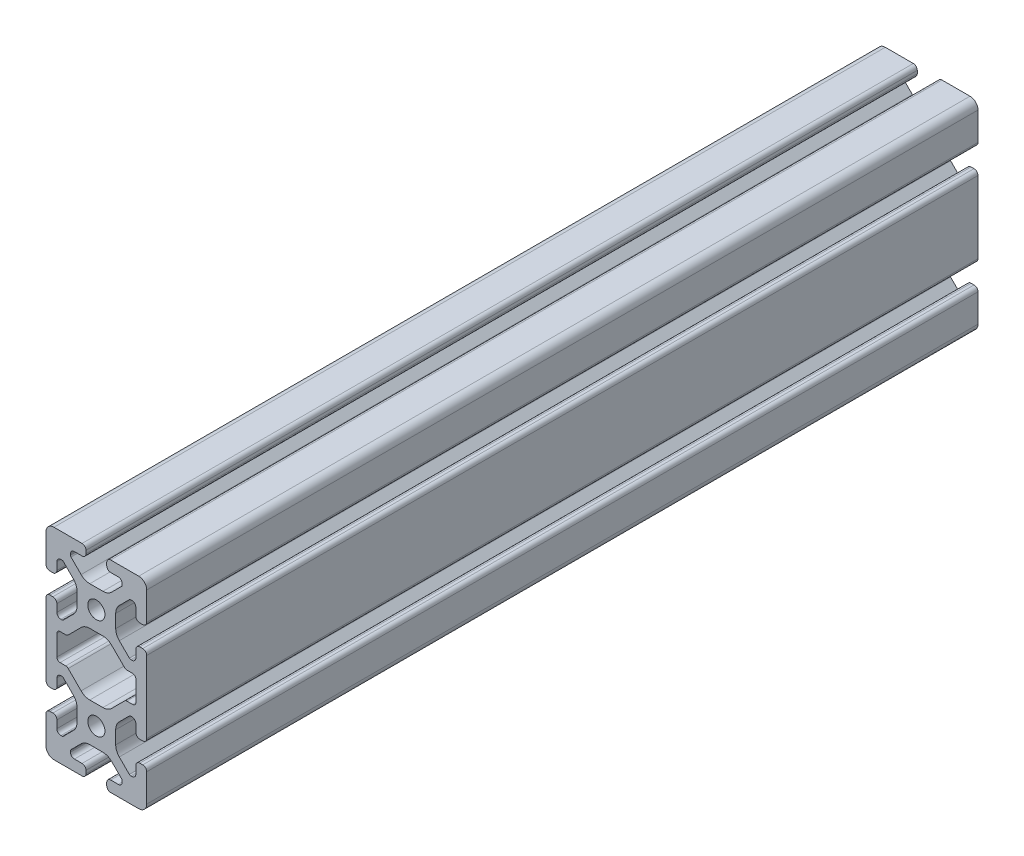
from build123d import *

# Parameters (mm, degrees)
SKETCH1_R           = 3.405
BOSS_EXTRUDE1_DEPTH = 3048
SKETCH26_W          = 40
SKETCH26_H          = 80.80011746
CUT_1_3FT_DEPTH     = 2135.537177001
SKETCH33_W          = 40
SKETCH33_H          = 80.80011746
CUT_2_3FT_DEPTH     = 1221.839317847
SKETCH41_W          = 40
SKETCH41_H          = 80.80011746
CUT_3_1FT_1IN_DEPTH = 892.246879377


with BuildPart() as part:
    # Sketch1 → Boss-Extrude1 (new body)
    with BuildSketch(Plane(origin=(0, 0, -3048), x_dir=(-1, 0, 0), z_dir=(0, 0, -1))):
        with BuildLine():
            Line((16.83, 60), (5.69044933, 60))
            ThreePointArc((5.69044933, 60), (4.580291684, 59.540157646), (4.12044933, 58.43))
            Line((4.12044933, 58.43), (4.12044933, 57.25))
            ThreePointArc((4.12044933, 57.25), (4.580291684, 56.139842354), (5.69044933, 55.68))
            Line((5.69044933, 55.68), (8.7153995, 55.68))
            ThreePointArc((8.7153995, 55.68), (9.825557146, 55.220157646), (10.2853995, 54.11))
            Line((10.2853995, 54.11), (10.2853995, 53.654903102))
            ThreePointArc((10.2853995, 53.654903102), (10.227547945, 53.364063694), (10.062800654, 53.117501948))
            Line((10.062800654, 53.117501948), (6.055092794, 49.109794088))
            ThreePointArc((6.055092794, 49.109794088), (4.47691877, 48.055291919), (2.615335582, 47.685))
            Line((2.615335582, 47.685), (-2.615335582, 47.685))
            ThreePointArc((-2.615335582, 47.685), (-4.47691877, 48.055291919), (-6.055092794, 49.109794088))
            Line((-6.055092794, 49.109794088), (-10.062800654, 53.117501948))
            ThreePointArc((-10.062800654, 53.117501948), (-10.227547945, 53.364063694), (-10.2853995, 53.654903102))
            Line((-10.2853995, 53.654903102), (-10.2853995, 54.11))
            ThreePointArc((-10.2853995, 54.11), (-9.825557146, 55.220157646), (-8.7153995, 55.68))
            Line((-8.7153995, 55.68), (-5.69044933, 55.68))
            ThreePointArc((-5.69044933, 55.68), (-4.580291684, 56.139842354), (-4.12044933, 57.25))
            Line((-4.12044933, 57.25), (-4.12044933, 58.43))
            ThreePointArc((-4.12044933, 58.43), (-4.580291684, 59.540157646), (-5.69044933, 60))
            Line((-5.69044933, 60), (-16.83, 60))
            ThreePointArc((-16.83, 60), (-19.071528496, 59.071528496), (-20, 56.83))
            Line((-20, 56.83), (-20, 45.69044933))
            ThreePointArc((-20, 45.69044933), (-19.540157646, 44.580291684), (-18.43, 44.12044933))
            Line((-18.43, 44.12044933), (-17.25, 44.12044933))
            ThreePointArc((-17.25, 44.12044933), (-16.139842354, 44.580291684), (-15.68, 45.69044933))
            Line((-15.68, 45.69044933), (-15.68, 48.7153995))
            ThreePointArc((-15.68, 48.7153995), (-15.220157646, 49.825557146), (-14.11, 50.2853995))
            Line((-14.11, 50.2853995), (-13.652670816, 50.2853995))
            ThreePointArc((-13.652670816, 50.2853995), (-13.361831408, 50.227547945), (-13.115269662, 50.062800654))
            Line((-13.115269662, 50.062800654), (-9.109794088, 46.05732508))
            ThreePointArc((-9.109794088, 46.05732508), (-8.055291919, 44.479151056), (-7.685, 42.617567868))
            Line((-7.685, 42.617567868), (-7.685, 37.384664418))
            ThreePointArc((-7.685, 37.384664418), (-8.055291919, 35.52308123), (-9.109794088, 33.944907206))
            Line((-9.109794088, 33.944907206), (-13.117501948, 29.937199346))
            ThreePointArc((-13.117501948, 29.937199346), (-13.364063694, 29.772452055), (-13.654903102, 29.7146005))
            Line((-13.654903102, 29.7146005), (-14.11, 29.7146005))
            ThreePointArc((-14.11, 29.7146005), (-15.220157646, 30.174442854), (-15.68, 31.2846005))
            Line((-15.68, 31.2846005), (-15.68, 34.30955067))
            ThreePointArc((-15.68, 34.30955067), (-16.139842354, 35.419708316), (-17.25, 35.87955067))
            Line((-17.25, 35.87955067), (-18.43, 35.87955067))
            ThreePointArc((-18.43, 35.87955067), (-19.540157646, 35.419708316), (-20, 34.30955067))
            Line((-20, 34.30955067), (-20, 5.69044933))
            ThreePointArc((-20, 5.69044933), (-19.540157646, 4.580291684), (-18.43, 4.12044933))
            Line((-18.43, 4.12044933), (-17.25, 4.12044933))
            ThreePointArc((-17.25, 4.12044933), (-16.139842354, 4.580291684), (-15.68, 5.69044933))
            Line((-15.68, 5.69044933), (-15.68, 8.7153995))
            ThreePointArc((-15.68, 8.7153995), (-15.220157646, 9.825557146), (-14.11, 10.2853995))
            Line((-14.11, 10.2853995), (-13.654903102, 10.2853995))
            ThreePointArc((-13.654903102, 10.2853995), (-13.364063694, 10.227547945), (-13.117501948, 10.062800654))
            Line((-13.117501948, 10.062800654), (-9.109794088, 6.055092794))
            ThreePointArc((-9.109794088, 6.055092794), (-8.055291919, 4.47691877), (-7.685, 2.615335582))
            Line((-7.685, 2.615335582), (-7.685, -2.615335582))
            ThreePointArc((-7.685, -2.615335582), (-8.055291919, -4.47691877), (-9.109794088, -6.055092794))
            Line((-9.109794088, -6.055092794), (-13.117501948, -10.062800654))
            ThreePointArc((-13.117501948, -10.062800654), (-13.364063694, -10.227547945), (-13.654903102, -10.2853995))
            Line((-13.654903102, -10.2853995), (-14.11, -10.2853995))
            ThreePointArc((-14.11, -10.2853995), (-15.220157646, -9.825557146), (-15.68, -8.7153995))
            Line((-15.68, -8.7153995), (-15.68, -5.69044933))
            ThreePointArc((-15.68, -5.69044933), (-16.139842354, -4.580291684), (-17.25, -4.12044933))
            Line((-17.25, -4.12044933), (-18.43, -4.12044933))
            ThreePointArc((-18.43, -4.12044933), (-19.540157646, -4.580291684), (-20, -5.69044933))
            Line((-20, -5.69044933), (-20, -16.83))
            ThreePointArc((-20, -16.83), (-19.071528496, -19.071528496), (-16.83, -20))
            Line((-16.83, -20), (-5.69044933, -20))
            ThreePointArc((-5.69044933, -20), (-4.580291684, -19.540157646), (-4.12044933, -18.43))
            Line((-4.12044933, -18.43), (-4.12044933, -17.25))
            ThreePointArc((-4.12044933, -17.25), (-4.580291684, -16.139842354), (-5.69044933, -15.68))
            Line((-5.69044933, -15.68), (-8.7153995, -15.68))
            ThreePointArc((-8.7153995, -15.68), (-9.825557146, -15.220157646), (-10.2853995, -14.11))
            Line((-10.2853995, -14.11), (-10.2853995, -13.654903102))
            ThreePointArc((-10.2853995, -13.654903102), (-10.227547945, -13.364063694), (-10.062800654, -13.117501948))
            Line((-10.062800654, -13.117501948), (-6.055092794, -9.109794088))
            ThreePointArc((-6.055092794, -9.109794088), (-4.47691877, -8.055291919), (-2.615335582, -7.685))
            Line((-2.615335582, -7.685), (2.615335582, -7.685))
            ThreePointArc((2.615335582, -7.685), (4.47691877, -8.055291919), (6.055092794, -9.109794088))
            Line((6.055092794, -9.109794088), (10.062800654, -13.117501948))
            ThreePointArc((10.062800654, -13.117501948), (10.227547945, -13.364063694), (10.2853995, -13.654903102))
            Line((10.2853995, -13.654903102), (10.2853995, -14.11))
            ThreePointArc((10.2853995, -14.11), (9.825557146, -15.220157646), (8.7153995, -15.68))
            Line((8.7153995, -15.68), (5.69044933, -15.68))
            ThreePointArc((5.69044933, -15.68), (4.580291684, -16.139842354), (4.12044933, -17.25))
            Line((4.12044933, -17.25), (4.12044933, -18.43))
            ThreePointArc((4.12044933, -18.43), (4.580291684, -19.540157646), (5.69044933, -20))
            Line((5.69044933, -20), (16.83, -20))
            ThreePointArc((16.83, -20), (19.071528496, -19.071528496), (20, -16.83))
            Line((20, -16.83), (20, -5.69044933))
            ThreePointArc((20, -5.69044933), (19.540157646, -4.580291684), (18.43, -4.12044933))
            Line((18.43, -4.12044933), (17.25, -4.12044933))
            ThreePointArc((17.25, -4.12044933), (16.139842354, -4.580291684), (15.68, -5.69044933))
            Line((15.68, -5.69044933), (15.68, -8.7153995))
            ThreePointArc((15.68, -8.7153995), (15.220157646, -9.825557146), (14.11, -10.2853995))
            Line((14.11, -10.2853995), (13.654903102, -10.2853995))
            ThreePointArc((13.654903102, -10.2853995), (13.364063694, -10.227547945), (13.117501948, -10.062800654))
            Line((13.117501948, -10.062800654), (9.109794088, -6.055092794))
            ThreePointArc((9.109794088, -6.055092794), (8.055291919, -4.47691877), (7.685, -2.615335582))
            Line((7.685, -2.615335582), (7.685, 2.615335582))
            ThreePointArc((7.685, 2.615335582), (8.055291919, 4.47691877), (9.109794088, 6.055092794))
            Line((9.109794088, 6.055092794), (13.117501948, 10.062800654))
            ThreePointArc((13.117501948, 10.062800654), (13.364063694, 10.227547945), (13.654903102, 10.2853995))
            Line((13.654903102, 10.2853995), (14.11, 10.2853995))
            ThreePointArc((14.11, 10.2853995), (15.220157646, 9.825557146), (15.68, 8.7153995))
            Line((15.68, 8.7153995), (15.68, 5.69044933))
            ThreePointArc((15.68, 5.69044933), (16.139842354, 4.580291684), (17.25, 4.12044933))
            Line((17.25, 4.12044933), (18.43, 4.12044933))
            ThreePointArc((18.43, 4.12044933), (19.540157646, 4.580291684), (20, 5.69044933))
            Line((20, 5.69044933), (20, 34.30955067))
            ThreePointArc((20, 34.30955067), (19.540157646, 35.419708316), (18.43, 35.87955067))
            Line((18.43, 35.87955067), (17.25, 35.87955067))
            ThreePointArc((17.25, 35.87955067), (16.139842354, 35.419708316), (15.68, 34.30955067))
            Line((15.68, 34.30955067), (15.68, 31.2846005))
            ThreePointArc((15.68, 31.2846005), (15.220157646, 30.174442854), (14.11, 29.7146005))
            Line((14.11, 29.7146005), (13.654903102, 29.7146005))
            ThreePointArc((13.654903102, 29.7146005), (13.364063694, 29.772452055), (13.117501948, 29.937199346))
            Line((13.117501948, 29.937199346), (9.109794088, 33.944907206))
            ThreePointArc((9.109794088, 33.944907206), (8.055291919, 35.52308123), (7.685, 37.384664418))
            Line((7.685, 37.384664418), (7.685, 42.615335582))
            ThreePointArc((7.685, 42.615335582), (8.055291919, 44.47691877), (9.109794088, 46.055092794))
            Line((9.109794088, 46.055092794), (13.117501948, 50.062800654))
            ThreePointArc((13.117501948, 50.062800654), (13.364063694, 50.227547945), (13.654903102, 50.2853995))
            Line((13.654903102, 50.2853995), (14.11, 50.2853995))
            ThreePointArc((14.11, 50.2853995), (15.220157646, 49.825557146), (15.68, 48.7153995))
            Line((15.68, 48.7153995), (15.68, 45.69044933))
            ThreePointArc((15.68, 45.69044933), (16.139842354, 44.580291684), (17.25, 44.12044933))
            Line((17.25, 44.12044933), (18.43, 44.12044933))
            ThreePointArc((18.43, 44.12044933), (19.540157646, 44.580291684), (20, 45.69044933))
            Line((20, 45.69044933), (20, 56.83))
            ThreePointArc((20, 56.83), (19.071528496, 59.071528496), (16.83, 60))
        make_face()
        with Locations(Location((0, 0, 0), (0, 0, 180))):
            Circle(SKETCH1_R, mode=Mode.SUBTRACT)
        with Locations(Location((0, 40, 0), (0, 0, 180))):
            Circle(SKETCH1_R, mode=Mode.SUBTRACT)
        with BuildLine():
            Line((14.41, 14.65864833), (12.129998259, 14.65864833))
            ThreePointArc((12.129998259, 14.65864833), (11.608780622, 14.546764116), (11.179399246, 14.230824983))
            Line((11.179399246, 14.230824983), (6.055092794, 9.109794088))
            ThreePointArc((6.055092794, 9.109794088), (4.47691877, 8.055291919), (2.615335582, 7.685))
            Line((2.615335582, 7.685), (-2.615335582, 7.685))
            ThreePointArc((-2.615335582, 7.685), (-4.47691877, 8.055291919), (-6.055092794, 9.109794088))
            Line((-6.055092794, 9.109794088), (-11.231972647, 14.286673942))
            ThreePointArc((-11.231972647, 14.286673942), (-11.6439903, 14.561975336), (-12.129998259, 14.65864833))
            Line((-12.129998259, 14.65864833), (-14.41, 14.65864833))
            ThreePointArc((-14.41, 14.65864833), (-15.308025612, 15.030622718), (-15.68, 15.92864833))
            Line((-15.68, 15.92864833), (-15.68, 24.07135167))
            ThreePointArc((-15.68, 24.07135167), (-15.308025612, 24.969377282), (-14.41, 25.34135167))
            Line((-14.41, 25.34135167), (-12.129998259, 25.34135167))
            ThreePointArc((-12.129998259, 25.34135167), (-11.6439903, 25.438024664), (-11.231972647, 25.713326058))
            Line((-11.231972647, 25.713326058), (-6.055092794, 30.890205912))
            ThreePointArc((-6.055092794, 30.890205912), (-4.47691877, 31.944708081), (-2.615335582, 32.315))
            Line((-2.615335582, 32.315), (2.617567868, 32.315))
            ThreePointArc((2.617567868, 32.315), (4.479151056, 31.944708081), (6.05732508, 30.890205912))
            Line((6.05732508, 30.890205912), (11.184160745, 25.763370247))
            ThreePointArc((11.184160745, 25.763370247), (11.612140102, 25.451641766), (12.129998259, 25.34135167))
            Line((12.129998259, 25.34135167), (14.41, 25.34135167))
            ThreePointArc((14.41, 25.34135167), (15.308025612, 24.969377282), (15.68, 24.07135167))
            Line((15.68, 24.07135167), (15.68, 15.92864833))
            ThreePointArc((15.68, 15.92864833), (15.308025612, 15.030622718), (14.41, 14.65864833))
        make_face(mode=Mode.SUBTRACT)
    extrude(amount=-BOSS_EXTRUDE1_DEPTH)

    # Sketch26 → Cut 1 - 3ft (cut, through all)
    with BuildSketch(Plane.XY.offset(-914.4)):
        with Locations((0, 19.59994127)):
            Rectangle(SKETCH26_W, SKETCH26_H)
    extrude(amount=CUT_1_3FT_DEPTH, mode=Mode.SUBTRACT)

    # Sketch33 → Cut 2 - 3ft (cut, through all)
    with BuildSketch(Plane.XY.offset(-1828.8)):
        with Locations((0, 19.59994127)):
            Rectangle(SKETCH33_W, SKETCH33_H)
    extrude(amount=CUT_2_3FT_DEPTH, mode=Mode.SUBTRACT)

    # Sketch41 → Cut 3 - 1ft _ 1in (cut, through all)
    with BuildSketch(Plane.XY.offset(-2159)):
        with Locations((0, 19.59994127)):
            Rectangle(SKETCH41_W, SKETCH41_H)
    extrude(amount=-CUT_3_1FT_1IN_DEPTH, mode=Mode.SUBTRACT)


solid = part.part
